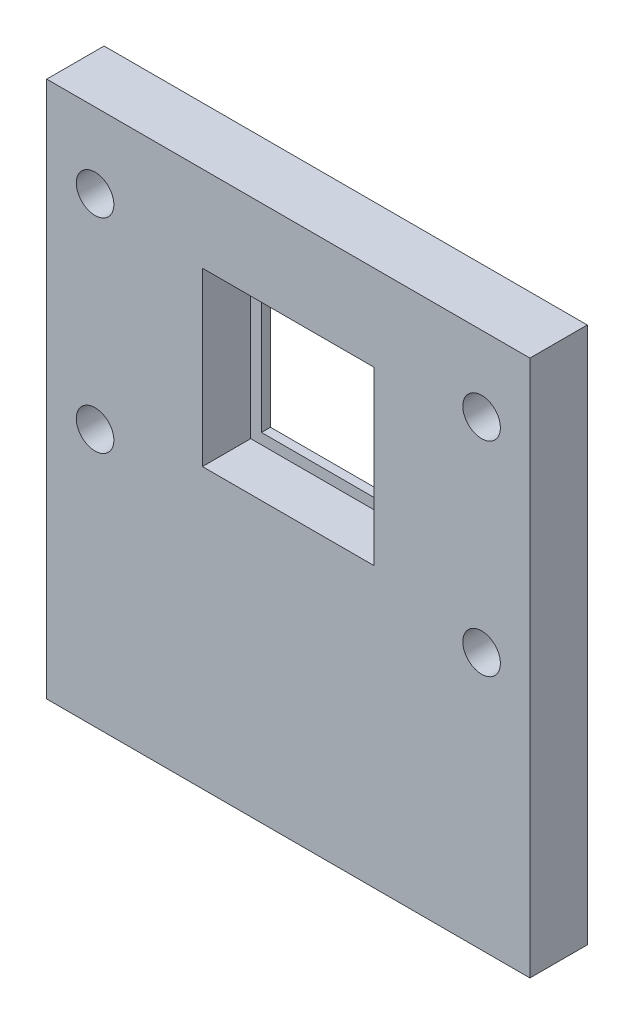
from build123d import *

# Parameters (mm, degrees)
SKETCH1_W           = 45
SKETCH1_H           = 50
BOSS_EXTRUDE1_DEPTH = 8.34
SKETCH2_W           = 16
SKETCH2_H           = 16
CUT_EXTRUDE1_DEPTH  = 4.5
SKETCH5_W           = 45
SKETCH5_H           = 50
CUT_EXTRUDE3_DEPTH  = 3
CUT_EXTRUDE5_REACH  = 36.055
SKETCH13_R          = 1.75
SKETCH16_W          = 14
SKETCH16_H          = 14
CUT_EXTRUDE8_DEPTH  = 34.933759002


with BuildPart() as part:
    # Sketch1 → Boss-Extrude1 (new body)
    with BuildSketch(Plane.XY):
        Rectangle(SKETCH1_W, SKETCH1_H)
    extrude(amount=BOSS_EXTRUDE1_DEPTH)

    # Sketch2 → Cut-Extrude1 (cut)
    with BuildSketch(Plane.XY.offset(8.34)):
        with Locations((0, 9)):
            Rectangle(SKETCH2_W, SKETCH2_H)
    extrude(amount=-CUT_EXTRUDE1_DEPTH, mode=Mode.SUBTRACT)

    # Sketch5 → Cut-Extrude3 (cut)
    with BuildSketch(Plane(origin=(0, 0, 0), x_dir=(-1, 0, 0), z_dir=(0, 0, -1))):
        Rectangle(SKETCH5_W, SKETCH5_H)
    extrude(amount=-CUT_EXTRUDE3_DEPTH, mode=Mode.SUBTRACT)

    # Sketch13 → Cut-Extrude5 (cut, up to next)
    with BuildSketch(Plane(origin=(0, 0, 3), x_dir=(-1, 0, 0), z_dir=(0, 0, -1)), mode=Mode.PRIVATE) as cut_extrude5_sk1:
        with Locations((-18, 18)):
            Circle(SKETCH13_R)
    cut_extrude5_tool1 = extrude(cut_extrude5_sk1.sketch, amount=-CUT_EXTRUDE5_REACH, mode=Mode.PRIVATE) & part.part
    # Sketch13 → Cut-Extrude5 (cut, up to next)
    with BuildSketch(Plane(origin=(0, 0, 3), x_dir=(-1, 0, 0), z_dir=(0, 0, -1)), mode=Mode.PRIVATE) as cut_extrude5_sk2:
        with Locations((18, 18)):
            Circle(SKETCH13_R)
    cut_extrude5_tool2 = extrude(cut_extrude5_sk2.sketch, amount=-CUT_EXTRUDE5_REACH, mode=Mode.PRIVATE) & part.part
    # Sketch13 → Cut-Extrude5 (cut, up to next)
    with BuildSketch(Plane(origin=(0, 0, 3), x_dir=(-1, 0, 0), z_dir=(0, 0, -1)), mode=Mode.PRIVATE) as cut_extrude5_sk3:
        with Locations((18, -1)):
            Circle(SKETCH13_R)
    cut_extrude5_tool3 = extrude(cut_extrude5_sk3.sketch, amount=-CUT_EXTRUDE5_REACH, mode=Mode.PRIVATE) & part.part
    # Sketch13 → Cut-Extrude5 (cut, up to next)
    with BuildSketch(Plane(origin=(0, 0, 3), x_dir=(-1, 0, 0), z_dir=(0, 0, -1)), mode=Mode.PRIVATE) as cut_extrude5_sk4:
        with Locations((-18, -1)):
            Circle(SKETCH13_R)
    cut_extrude5_tool4 = extrude(cut_extrude5_sk4.sketch, amount=-CUT_EXTRUDE5_REACH, mode=Mode.PRIVATE) & part.part
    add(cut_extrude5_tool1.solids().sort_by_distance((18, 18, 3))[0], mode=Mode.SUBTRACT)
    add(cut_extrude5_tool2.solids().sort_by_distance((-18, 18, 3))[0], mode=Mode.SUBTRACT)
    add(cut_extrude5_tool3.solids().sort_by_distance((-18, -1, 3))[0], mode=Mode.SUBTRACT)
    add(cut_extrude5_tool4.solids().sort_by_distance((18, -1, 3))[0], mode=Mode.SUBTRACT)

    # Sketch16 → Cut-Extrude8 (cut, through all)
    with BuildSketch(Plane.XY.offset(3.84)):
        with Locations((0, 9)):
            Rectangle(SKETCH16_W, SKETCH16_H)
    extrude(amount=-CUT_EXTRUDE8_DEPTH, mode=Mode.SUBTRACT)


solid = part.part
